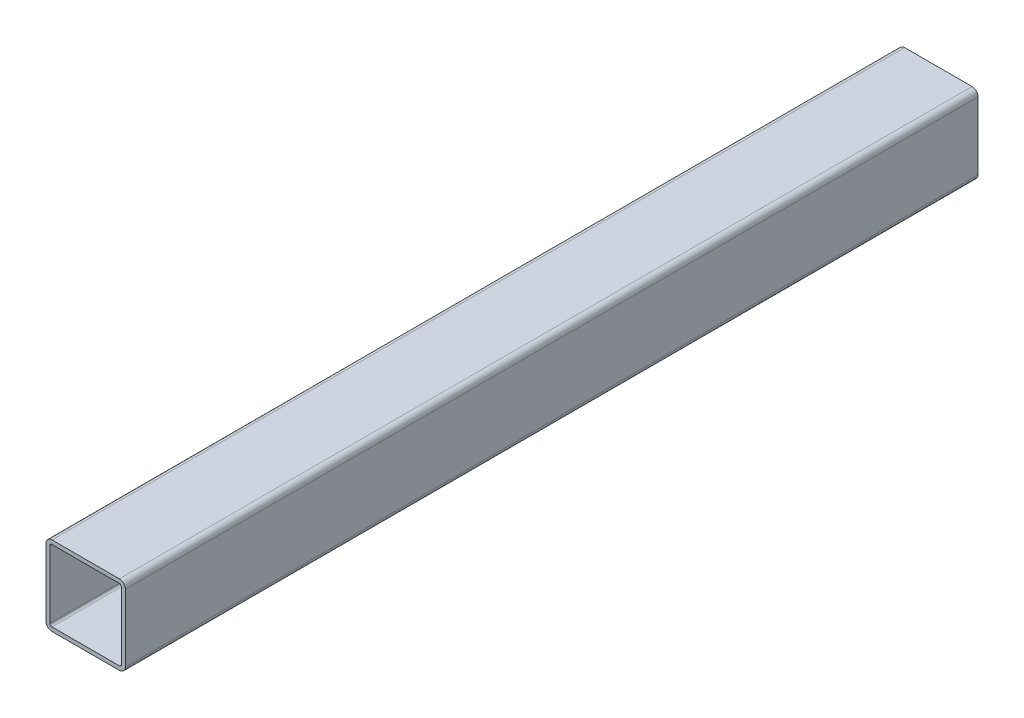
ISO-10303-21;
HEADER;
FILE_DESCRIPTION(('STEP AP214'),'2;1');
FILE_NAME('part.step','',(''),(''),'','','');
FILE_SCHEMA(('AUTOMOTIVE_DESIGN { 1 0 10303 214 1 1 1 1 }'));
ENDSEC;
DATA;
#1=APPLICATION_CONTEXT('core data for automotive mechanical design processes');
#2=APPLICATION_PROTOCOL_DEFINITION('international standard','automotive_design',2000,#1);
#3=PRODUCT_CONTEXT('',#1,'mechanical');
#4=PRODUCT('Part','Part','',(#3));
#5=PRODUCT_RELATED_PRODUCT_CATEGORY('part','',(#4));
#6=PRODUCT_DEFINITION_FORMATION('','',#4);
#7=PRODUCT_DEFINITION_CONTEXT('part definition',#1,'design');
#8=PRODUCT_DEFINITION('design','',#6,#7);
#9=PRODUCT_DEFINITION_SHAPE('','',#8);
#10=(LENGTH_UNIT() NAMED_UNIT(*) SI_UNIT(.MILLI.,.METRE.));
#11=(NAMED_UNIT(*) PLANE_ANGLE_UNIT() SI_UNIT($,.RADIAN.));
#12=(NAMED_UNIT(*) SI_UNIT($,.STERADIAN.) SOLID_ANGLE_UNIT());
#13=UNCERTAINTY_MEASURE_WITH_UNIT(LENGTH_MEASURE(1.E-05),#10,'distance_accuracy_value','');
#14=(GEOMETRIC_REPRESENTATION_CONTEXT(3) GLOBAL_UNCERTAINTY_ASSIGNED_CONTEXT((#13)) GLOBAL_UNIT_ASSIGNED_CONTEXT((#10,
#11,#12)) REPRESENTATION_CONTEXT('',''));
#15=CARTESIAN_POINT('',(0.,0.,0.));
#16=DIRECTION('',(0.,0.,1.));
#17=DIRECTION('',(1.,0.,0.));
#18=AXIS2_PLACEMENT_3D('',#15,#16,#17);
#19=CARTESIAN_POINT('',(3.,37.,430.));
#20=DIRECTION('',(0.,0.,1.));
#21=DIRECTION('',(1.,0.,0.));
#22=AXIS2_PLACEMENT_3D('',#19,#20,#21);
#23=PLANE('',#22);
#24=CARTESIAN_POINT('',(3.,37.,430.));
#25=DIRECTION('',(0.,0.,1.));
#26=DIRECTION('',(1.,0.,0.));
#27=AXIS2_PLACEMENT_3D('',#24,#25,#26);
#28=CIRCLE('',#27,3.);
#29=CARTESIAN_POINT('',(3.00000000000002,40.,430.));
#30=VERTEX_POINT('',#29);
#31=CARTESIAN_POINT('',(0.,37.,430.));
#32=VERTEX_POINT('',#31);
#33=EDGE_CURVE('E217',#30,#32,#28,.T.);
#34=ORIENTED_EDGE('',*,*,#33,.T.);
#35=DIRECTION('',(0.,-1.,0.));
#36=VECTOR('',#35,1.);
#37=CARTESIAN_POINT('',(0.,3.00000000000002,430.));
#38=LINE('',#37,#36);
#39=CARTESIAN_POINT('',(0.,3.00000000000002,430.));
#40=VERTEX_POINT('',#39);
#41=EDGE_CURVE('E220',#32,#40,#38,.T.);
#42=ORIENTED_EDGE('',*,*,#41,.T.);
#43=CARTESIAN_POINT('',(3.,3.,430.));
#44=DIRECTION('',(0.,0.,1.));
#45=DIRECTION('',(1.,0.,0.));
#46=AXIS2_PLACEMENT_3D('',#43,#44,#45);
#47=CIRCLE('',#46,3.);
#48=CARTESIAN_POINT('',(3.00000000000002,0.,430.));
#49=VERTEX_POINT('',#48);
#50=EDGE_CURVE('E222',#40,#49,#47,.T.);
#51=ORIENTED_EDGE('',*,*,#50,.T.);
#52=DIRECTION('',(1.,0.,0.));
#53=VECTOR('',#52,1.);
#54=CARTESIAN_POINT('',(3.00000000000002,0.,430.));
#55=LINE('',#54,#53);
#56=CARTESIAN_POINT('',(37.,0.,430.));
#57=VERTEX_POINT('',#56);
#58=EDGE_CURVE('E224',#49,#57,#55,.T.);
#59=ORIENTED_EDGE('',*,*,#58,.T.);
#60=CARTESIAN_POINT('',(37.,3.,430.));
#61=DIRECTION('',(0.,0.,1.));
#62=DIRECTION('',(1.,0.,0.));
#63=AXIS2_PLACEMENT_3D('',#60,#61,#62);
#64=CIRCLE('',#63,3.);
#65=CARTESIAN_POINT('',(40.,3.00000000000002,430.));
#66=VERTEX_POINT('',#65);
#67=EDGE_CURVE('E226',#57,#66,#64,.T.);
#68=ORIENTED_EDGE('',*,*,#67,.T.);
#69=DIRECTION('',(0.,1.,0.));
#70=VECTOR('',#69,1.);
#71=CARTESIAN_POINT('',(40.,3.00000000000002,430.));
#72=LINE('',#71,#70);
#73=CARTESIAN_POINT('',(40.,37.,430.));
#74=VERTEX_POINT('',#73);
#75=EDGE_CURVE('E228',#66,#74,#72,.T.);
#76=ORIENTED_EDGE('',*,*,#75,.T.);
#77=CARTESIAN_POINT('',(37.,37.,430.));
#78=DIRECTION('',(0.,0.,1.));
#79=DIRECTION('',(1.,0.,0.));
#80=AXIS2_PLACEMENT_3D('',#77,#78,#79);
#81=CIRCLE('',#80,3.);
#82=CARTESIAN_POINT('',(37.,40.,430.));
#83=VERTEX_POINT('',#82);
#84=EDGE_CURVE('E230',#74,#83,#81,.T.);
#85=ORIENTED_EDGE('',*,*,#84,.T.);
#86=DIRECTION('',(-1.,0.,0.));
#87=VECTOR('',#86,1.);
#88=CARTESIAN_POINT('',(3.00000000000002,40.,430.));
#89=LINE('',#88,#87);
#90=EDGE_CURVE('E232',#83,#30,#89,.T.);
#91=ORIENTED_EDGE('',*,*,#90,.T.);
#92=EDGE_LOOP('',(#34,#42,#51,#59,#68,#76,#85,#91));
#93=FACE_BOUND('',#92,.T.);
#94=DIRECTION('',(0.,-1.,0.));
#95=VECTOR('',#94,1.);
#96=CARTESIAN_POINT('',(2.,3.00000000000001,430.));
#97=LINE('',#96,#95);
#98=CARTESIAN_POINT('',(2.,37.,430.));
#99=VERTEX_POINT('',#98);
#100=CARTESIAN_POINT('',(2.,3.00000000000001,430.));
#101=VERTEX_POINT('',#100);
#102=EDGE_CURVE('E175',#99,#101,#97,.T.);
#103=ORIENTED_EDGE('',*,*,#102,.F.);
#104=CARTESIAN_POINT('',(3.,37.,430.));
#105=DIRECTION('',(0.,0.,1.));
#106=DIRECTION('',(1.,0.,0.));
#107=AXIS2_PLACEMENT_3D('',#104,#105,#106);
#108=CIRCLE('',#107,1.);
#109=CARTESIAN_POINT('',(3.00000000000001,38.,430.));
#110=VERTEX_POINT('',#109);
#111=EDGE_CURVE('E152',#110,#99,#108,.T.);
#112=ORIENTED_EDGE('',*,*,#111,.F.);
#113=DIRECTION('',(-1.,0.,0.));
#114=VECTOR('',#113,1.);
#115=CARTESIAN_POINT('',(3.00000000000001,38.,430.));
#116=LINE('',#115,#114);
#117=CARTESIAN_POINT('',(37.,38.,430.));
#118=VERTEX_POINT('',#117);
#119=EDGE_CURVE('E187',#118,#110,#116,.T.);
#120=ORIENTED_EDGE('',*,*,#119,.F.);
#121=CARTESIAN_POINT('',(37.,37.,430.));
#122=DIRECTION('',(0.,0.,1.));
#123=DIRECTION('',(1.,0.,0.));
#124=AXIS2_PLACEMENT_3D('',#121,#122,#123);
#125=CIRCLE('',#124,1.);
#126=CARTESIAN_POINT('',(38.,37.,430.));
#127=VERTEX_POINT('',#126);
#128=EDGE_CURVE('E185',#127,#118,#125,.T.);
#129=ORIENTED_EDGE('',*,*,#128,.F.);
#130=DIRECTION('',(0.,1.,0.));
#131=VECTOR('',#130,1.);
#132=CARTESIAN_POINT('',(38.,3.00000000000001,430.));
#133=LINE('',#132,#131);
#134=CARTESIAN_POINT('',(38.,3.00000000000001,430.));
#135=VERTEX_POINT('',#134);
#136=EDGE_CURVE('E183',#135,#127,#133,.T.);
#137=ORIENTED_EDGE('',*,*,#136,.F.);
#138=CARTESIAN_POINT('',(37.,3.,430.));
#139=DIRECTION('',(0.,0.,1.));
#140=DIRECTION('',(1.,0.,0.));
#141=AXIS2_PLACEMENT_3D('',#138,#139,#140);
#142=CIRCLE('',#141,1.);
#143=CARTESIAN_POINT('',(37.,2.,430.));
#144=VERTEX_POINT('',#143);
#145=EDGE_CURVE('E181',#144,#135,#142,.T.);
#146=ORIENTED_EDGE('',*,*,#145,.F.);
#147=DIRECTION('',(1.,0.,0.));
#148=VECTOR('',#147,1.);
#149=CARTESIAN_POINT('',(3.00000000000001,2.,430.));
#150=LINE('',#149,#148);
#151=CARTESIAN_POINT('',(3.00000000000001,2.,430.));
#152=VERTEX_POINT('',#151);
#153=EDGE_CURVE('E179',#152,#144,#150,.T.);
#154=ORIENTED_EDGE('',*,*,#153,.F.);
#155=CARTESIAN_POINT('',(3.,3.,430.));
#156=DIRECTION('',(0.,0.,1.));
#157=DIRECTION('',(1.,0.,0.));
#158=AXIS2_PLACEMENT_3D('',#155,#156,#157);
#159=CIRCLE('',#158,1.);
#160=EDGE_CURVE('E177',#101,#152,#159,.T.);
#161=ORIENTED_EDGE('',*,*,#160,.F.);
#162=EDGE_LOOP('',(#103,#112,#120,#129,#137,#146,#154,#161));
#163=FACE_BOUND('',#162,.T.);
#164=ADVANCED_FACE('F24',(#93,#163),#23,.T.);
#165=CARTESIAN_POINT('',(3.,37.,0.));
#166=DIRECTION('',(0.,0.,1.));
#167=DIRECTION('',(1.,0.,0.));
#168=AXIS2_PLACEMENT_3D('',#165,#166,#167);
#169=PLANE('',#168);
#170=CARTESIAN_POINT('',(3.,37.,0.));
#171=DIRECTION('',(0.,0.,1.));
#172=DIRECTION('',(1.,0.,0.));
#173=AXIS2_PLACEMENT_3D('',#170,#171,#172);
#174=CIRCLE('',#173,3.);
#175=CARTESIAN_POINT('',(3.00000000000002,40.,0.));
#176=VERTEX_POINT('',#175);
#177=CARTESIAN_POINT('',(0.,37.,0.));
#178=VERTEX_POINT('',#177);
#179=EDGE_CURVE('E153',#176,#178,#174,.T.);
#180=ORIENTED_EDGE('',*,*,#179,.F.);
#181=DIRECTION('',(-1.,0.,0.));
#182=VECTOR('',#181,1.);
#183=CARTESIAN_POINT('',(3.00000000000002,40.,0.));
#184=LINE('',#183,#182);
#185=CARTESIAN_POINT('',(37.,40.,0.));
#186=VERTEX_POINT('',#185);
#187=EDGE_CURVE('E215',#186,#176,#184,.T.);
#188=ORIENTED_EDGE('',*,*,#187,.F.);
#189=CARTESIAN_POINT('',(37.,37.,0.));
#190=DIRECTION('',(0.,0.,1.));
#191=DIRECTION('',(1.,0.,0.));
#192=AXIS2_PLACEMENT_3D('',#189,#190,#191);
#193=CIRCLE('',#192,3.);
#194=CARTESIAN_POINT('',(40.,37.,0.));
#195=VERTEX_POINT('',#194);
#196=EDGE_CURVE('E213',#195,#186,#193,.T.);
#197=ORIENTED_EDGE('',*,*,#196,.F.);
#198=DIRECTION('',(0.,1.,0.));
#199=VECTOR('',#198,1.);
#200=CARTESIAN_POINT('',(40.,3.00000000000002,0.));
#201=LINE('',#200,#199);
#202=CARTESIAN_POINT('',(40.,3.00000000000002,0.));
#203=VERTEX_POINT('',#202);
#204=EDGE_CURVE('E211',#203,#195,#201,.T.);
#205=ORIENTED_EDGE('',*,*,#204,.F.);
#206=CARTESIAN_POINT('',(37.,3.,0.));
#207=DIRECTION('',(0.,0.,1.));
#208=DIRECTION('',(1.,0.,0.));
#209=AXIS2_PLACEMENT_3D('',#206,#207,#208);
#210=CIRCLE('',#209,3.);
#211=CARTESIAN_POINT('',(37.,0.,0.));
#212=VERTEX_POINT('',#211);
#213=EDGE_CURVE('E209',#212,#203,#210,.T.);
#214=ORIENTED_EDGE('',*,*,#213,.F.);
#215=DIRECTION('',(1.,0.,0.));
#216=VECTOR('',#215,1.);
#217=CARTESIAN_POINT('',(3.00000000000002,0.,0.));
#218=LINE('',#217,#216);
#219=CARTESIAN_POINT('',(3.00000000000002,0.,0.));
#220=VERTEX_POINT('',#219);
#221=EDGE_CURVE('E207',#220,#212,#218,.T.);
#222=ORIENTED_EDGE('',*,*,#221,.F.);
#223=CARTESIAN_POINT('',(3.,3.,0.));
#224=DIRECTION('',(0.,0.,1.));
#225=DIRECTION('',(1.,0.,0.));
#226=AXIS2_PLACEMENT_3D('',#223,#224,#225);
#227=CIRCLE('',#226,3.);
#228=CARTESIAN_POINT('',(0.,3.00000000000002,0.));
#229=VERTEX_POINT('',#228);
#230=EDGE_CURVE('E205',#229,#220,#227,.T.);
#231=ORIENTED_EDGE('',*,*,#230,.F.);
#232=DIRECTION('',(0.,-1.,0.));
#233=VECTOR('',#232,1.);
#234=CARTESIAN_POINT('',(0.,3.00000000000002,0.));
#235=LINE('',#234,#233);
#236=EDGE_CURVE('E203',#178,#229,#235,.T.);
#237=ORIENTED_EDGE('',*,*,#236,.F.);
#238=EDGE_LOOP('',(#180,#188,#197,#205,#214,#222,#231,#237));
#239=FACE_BOUND('',#238,.T.);
#240=CARTESIAN_POINT('',(3.,37.,0.));
#241=DIRECTION('',(0.,0.,1.));
#242=DIRECTION('',(1.,0.,0.));
#243=AXIS2_PLACEMENT_3D('',#240,#241,#242);
#244=CIRCLE('',#243,1.);
#245=CARTESIAN_POINT('',(3.00000000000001,38.,0.));
#246=VERTEX_POINT('',#245);
#247=CARTESIAN_POINT('',(2.,37.,0.));
#248=VERTEX_POINT('',#247);
#249=EDGE_CURVE('E47',#246,#248,#244,.T.);
#250=ORIENTED_EDGE('',*,*,#249,.T.);
#251=DIRECTION('',(0.,-1.,0.));
#252=VECTOR('',#251,1.);
#253=CARTESIAN_POINT('',(2.,3.00000000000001,0.));
#254=LINE('',#253,#252);
#255=CARTESIAN_POINT('',(2.,3.00000000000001,0.));
#256=VERTEX_POINT('',#255);
#257=EDGE_CURVE('E139',#248,#256,#254,.T.);
#258=ORIENTED_EDGE('',*,*,#257,.T.);
#259=CARTESIAN_POINT('',(3.,3.,0.));
#260=DIRECTION('',(0.,0.,1.));
#261=DIRECTION('',(1.,0.,0.));
#262=AXIS2_PLACEMENT_3D('',#259,#260,#261);
#263=CIRCLE('',#262,1.);
#264=CARTESIAN_POINT('',(3.00000000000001,2.,0.));
#265=VERTEX_POINT('',#264);
#266=EDGE_CURVE('E148',#256,#265,#263,.T.);
#267=ORIENTED_EDGE('',*,*,#266,.T.);
#268=DIRECTION('',(1.,0.,0.));
#269=VECTOR('',#268,1.);
#270=CARTESIAN_POINT('',(3.00000000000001,2.,0.));
#271=LINE('',#270,#269);
#272=CARTESIAN_POINT('',(37.,2.,0.));
#273=VERTEX_POINT('',#272);
#274=EDGE_CURVE('E162',#265,#273,#271,.T.);
#275=ORIENTED_EDGE('',*,*,#274,.T.);
#276=CARTESIAN_POINT('',(37.,3.,0.));
#277=DIRECTION('',(0.,0.,1.));
#278=DIRECTION('',(1.,0.,0.));
#279=AXIS2_PLACEMENT_3D('',#276,#277,#278);
#280=CIRCLE('',#279,1.);
#281=CARTESIAN_POINT('',(38.,3.00000000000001,0.));
#282=VERTEX_POINT('',#281);
#283=EDGE_CURVE('E165',#273,#282,#280,.T.);
#284=ORIENTED_EDGE('',*,*,#283,.T.);
#285=DIRECTION('',(0.,1.,0.));
#286=VECTOR('',#285,1.);
#287=CARTESIAN_POINT('',(38.,3.00000000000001,0.));
#288=LINE('',#287,#286);
#289=CARTESIAN_POINT('',(38.,37.,0.));
#290=VERTEX_POINT('',#289);
#291=EDGE_CURVE('E168',#282,#290,#288,.T.);
#292=ORIENTED_EDGE('',*,*,#291,.T.);
#293=CARTESIAN_POINT('',(37.,37.,0.));
#294=DIRECTION('',(0.,0.,1.));
#295=DIRECTION('',(1.,0.,0.));
#296=AXIS2_PLACEMENT_3D('',#293,#294,#295);
#297=CIRCLE('',#296,1.);
#298=CARTESIAN_POINT('',(37.,38.,0.));
#299=VERTEX_POINT('',#298);
#300=EDGE_CURVE('E171',#290,#299,#297,.T.);
#301=ORIENTED_EDGE('',*,*,#300,.T.);
#302=DIRECTION('',(-1.,0.,0.));
#303=VECTOR('',#302,1.);
#304=CARTESIAN_POINT('',(3.00000000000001,38.,0.));
#305=LINE('',#304,#303);
#306=EDGE_CURVE('E158',#299,#246,#305,.T.);
#307=ORIENTED_EDGE('',*,*,#306,.T.);
#308=EDGE_LOOP('',(#250,#258,#267,#275,#284,#292,#301,#307));
#309=FACE_BOUND('',#308,.T.);
#310=ADVANCED_FACE('F156',(#239,#309),#169,.F.);
#311=CARTESIAN_POINT('',(3.,37.,430.));
#312=DIRECTION('',(0.,0.,-1.));
#313=DIRECTION('',(-1.,0.,0.));
#314=AXIS2_PLACEMENT_3D('',#311,#312,#313);
#315=CYLINDRICAL_SURFACE('',#314,3.);
#316=ORIENTED_EDGE('',*,*,#179,.T.);
#317=DIRECTION('',(0.,0.,-1.));
#318=VECTOR('',#317,1.);
#319=CARTESIAN_POINT('',(0.,37.,430.));
#320=LINE('',#319,#318);
#321=EDGE_CURVE('E11',#32,#178,#320,.T.);
#322=ORIENTED_EDGE('',*,*,#321,.F.);
#323=ORIENTED_EDGE('',*,*,#33,.F.);
#324=DIRECTION('',(0.,0.,-1.));
#325=VECTOR('',#324,1.);
#326=CARTESIAN_POINT('',(3.00000000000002,40.,430.));
#327=LINE('',#326,#325);
#328=EDGE_CURVE('E234',#30,#176,#327,.T.);
#329=ORIENTED_EDGE('',*,*,#328,.T.);
#330=EDGE_LOOP('',(#316,#322,#323,#329));
#331=FACE_BOUND('',#330,.T.);
#332=ADVANCED_FACE('F26',(#331),#315,.T.);
#333=CARTESIAN_POINT('',(0.,3.00000000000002,430.));
#334=DIRECTION('',(1.,0.,0.));
#335=DIRECTION('',(0.,0.,-1.));
#336=AXIS2_PLACEMENT_3D('',#333,#334,#335);
#337=PLANE('',#336);
#338=ORIENTED_EDGE('',*,*,#236,.T.);
#339=DIRECTION('',(0.,0.,-1.));
#340=VECTOR('',#339,1.);
#341=CARTESIAN_POINT('',(0.,3.00000000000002,430.));
#342=LINE('',#341,#340);
#343=EDGE_CURVE('E32',#40,#229,#342,.T.);
#344=ORIENTED_EDGE('',*,*,#343,.F.);
#345=ORIENTED_EDGE('',*,*,#41,.F.);
#346=ORIENTED_EDGE('',*,*,#321,.T.);
#347=EDGE_LOOP('',(#338,#344,#345,#346));
#348=FACE_BOUND('',#347,.T.);
#349=ADVANCED_FACE('F278',(#348),#337,.F.);
#350=CARTESIAN_POINT('',(3.,3.,430.));
#351=DIRECTION('',(0.,0.,-1.));
#352=DIRECTION('',(-1.,0.,0.));
#353=AXIS2_PLACEMENT_3D('',#350,#351,#352);
#354=CYLINDRICAL_SURFACE('',#353,3.);
#355=ORIENTED_EDGE('',*,*,#230,.T.);
#356=DIRECTION('',(0.,0.,-1.));
#357=VECTOR('',#356,1.);
#358=CARTESIAN_POINT('',(3.00000000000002,0.,430.));
#359=LINE('',#358,#357);
#360=EDGE_CURVE('E249',#49,#220,#359,.T.);
#361=ORIENTED_EDGE('',*,*,#360,.F.);
#362=ORIENTED_EDGE('',*,*,#50,.F.);
#363=ORIENTED_EDGE('',*,*,#343,.T.);
#364=EDGE_LOOP('',(#355,#361,#362,#363));
#365=FACE_BOUND('',#364,.T.);
#366=ADVANCED_FACE('F256',(#365),#354,.T.);
#367=CARTESIAN_POINT('',(3.00000000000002,0.,430.));
#368=DIRECTION('',(0.,1.,0.));
#369=DIRECTION('',(0.,0.,1.));
#370=AXIS2_PLACEMENT_3D('',#367,#368,#369);
#371=PLANE('',#370);
#372=ORIENTED_EDGE('',*,*,#221,.T.);
#373=DIRECTION('',(0.,0.,-1.));
#374=VECTOR('',#373,1.);
#375=CARTESIAN_POINT('',(37.,0.,430.));
#376=LINE('',#375,#374);
#377=EDGE_CURVE('E246',#57,#212,#376,.T.);
#378=ORIENTED_EDGE('',*,*,#377,.F.);
#379=ORIENTED_EDGE('',*,*,#58,.F.);
#380=ORIENTED_EDGE('',*,*,#360,.T.);
#381=EDGE_LOOP('',(#372,#378,#379,#380));
#382=FACE_BOUND('',#381,.T.);
#383=ADVANCED_FACE('F266',(#382),#371,.F.);
#384=CARTESIAN_POINT('',(37.,3.,430.));
#385=DIRECTION('',(0.,0.,-1.));
#386=DIRECTION('',(-1.,0.,0.));
#387=AXIS2_PLACEMENT_3D('',#384,#385,#386);
#388=CYLINDRICAL_SURFACE('',#387,3.);
#389=ORIENTED_EDGE('',*,*,#213,.T.);
#390=DIRECTION('',(0.,0.,-1.));
#391=VECTOR('',#390,1.);
#392=CARTESIAN_POINT('',(40.,3.00000000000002,430.));
#393=LINE('',#392,#391);
#394=EDGE_CURVE('E243',#66,#203,#393,.T.);
#395=ORIENTED_EDGE('',*,*,#394,.F.);
#396=ORIENTED_EDGE('',*,*,#67,.F.);
#397=ORIENTED_EDGE('',*,*,#377,.T.);
#398=EDGE_LOOP('',(#389,#395,#396,#397));
#399=FACE_BOUND('',#398,.T.);
#400=ADVANCED_FACE('F270',(#399),#388,.T.);
#401=CARTESIAN_POINT('',(40.,3.00000000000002,430.));
#402=DIRECTION('',(-1.,0.,0.));
#403=DIRECTION('',(0.,0.,1.));
#404=AXIS2_PLACEMENT_3D('',#401,#402,#403);
#405=PLANE('',#404);
#406=ORIENTED_EDGE('',*,*,#204,.T.);
#407=DIRECTION('',(0.,0.,-1.));
#408=VECTOR('',#407,1.);
#409=CARTESIAN_POINT('',(40.,37.,430.));
#410=LINE('',#409,#408);
#411=EDGE_CURVE('E240',#74,#195,#410,.T.);
#412=ORIENTED_EDGE('',*,*,#411,.F.);
#413=ORIENTED_EDGE('',*,*,#75,.F.);
#414=ORIENTED_EDGE('',*,*,#394,.T.);
#415=EDGE_LOOP('',(#406,#412,#413,#414));
#416=FACE_BOUND('',#415,.T.);
#417=ADVANCED_FACE('F291',(#416),#405,.F.);
#418=CARTESIAN_POINT('',(37.,37.,430.));
#419=DIRECTION('',(0.,0.,-1.));
#420=DIRECTION('',(-1.,0.,0.));
#421=AXIS2_PLACEMENT_3D('',#418,#419,#420);
#422=CYLINDRICAL_SURFACE('',#421,3.);
#423=ORIENTED_EDGE('',*,*,#196,.T.);
#424=DIRECTION('',(0.,0.,-1.));
#425=VECTOR('',#424,1.);
#426=CARTESIAN_POINT('',(37.,40.,430.));
#427=LINE('',#426,#425);
#428=EDGE_CURVE('E237',#83,#186,#427,.T.);
#429=ORIENTED_EDGE('',*,*,#428,.F.);
#430=ORIENTED_EDGE('',*,*,#84,.F.);
#431=ORIENTED_EDGE('',*,*,#411,.T.);
#432=EDGE_LOOP('',(#423,#429,#430,#431));
#433=FACE_BOUND('',#432,.T.);
#434=ADVANCED_FACE('F289',(#433),#422,.T.);
#435=CARTESIAN_POINT('',(3.00000000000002,40.,430.));
#436=DIRECTION('',(0.,-1.,0.));
#437=DIRECTION('',(0.,0.,-1.));
#438=AXIS2_PLACEMENT_3D('',#435,#436,#437);
#439=PLANE('',#438);
#440=ORIENTED_EDGE('',*,*,#187,.T.);
#441=ORIENTED_EDGE('',*,*,#328,.F.);
#442=ORIENTED_EDGE('',*,*,#90,.F.);
#443=ORIENTED_EDGE('',*,*,#428,.T.);
#444=EDGE_LOOP('',(#440,#441,#442,#443));
#445=FACE_BOUND('',#444,.T.);
#446=ADVANCED_FACE('F284',(#445),#439,.F.);
#447=CARTESIAN_POINT('',(3.,37.,430.));
#448=DIRECTION('',(0.,0.,-1.));
#449=DIRECTION('',(-1.,0.,0.));
#450=AXIS2_PLACEMENT_3D('',#447,#448,#449);
#451=CYLINDRICAL_SURFACE('',#450,1.);
#452=ORIENTED_EDGE('',*,*,#249,.F.);
#453=DIRECTION('',(0.,0.,-1.));
#454=VECTOR('',#453,1.);
#455=CARTESIAN_POINT('',(3.00000000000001,38.,430.));
#456=LINE('',#455,#454);
#457=EDGE_CURVE('E189',#110,#246,#456,.T.);
#458=ORIENTED_EDGE('',*,*,#457,.F.);
#459=ORIENTED_EDGE('',*,*,#111,.T.);
#460=DIRECTION('',(0.,0.,-1.));
#461=VECTOR('',#460,1.);
#462=CARTESIAN_POINT('',(2.,37.,430.));
#463=LINE('',#462,#461);
#464=EDGE_CURVE('E141',#99,#248,#463,.T.);
#465=ORIENTED_EDGE('',*,*,#464,.T.);
#466=EDGE_LOOP('',(#452,#458,#459,#465));
#467=FACE_BOUND('',#466,.T.);
#468=ADVANCED_FACE('F150',(#467),#451,.F.);
#469=CARTESIAN_POINT('',(2.,3.00000000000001,430.));
#470=DIRECTION('',(1.,0.,0.));
#471=DIRECTION('',(0.,0.,-1.));
#472=AXIS2_PLACEMENT_3D('',#469,#470,#471);
#473=PLANE('',#472);
#474=ORIENTED_EDGE('',*,*,#257,.F.);
#475=ORIENTED_EDGE('',*,*,#464,.F.);
#476=ORIENTED_EDGE('',*,*,#102,.T.);
#477=DIRECTION('',(0.,0.,-1.));
#478=VECTOR('',#477,1.);
#479=CARTESIAN_POINT('',(2.,3.00000000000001,430.));
#480=LINE('',#479,#478);
#481=EDGE_CURVE('E144',#101,#256,#480,.T.);
#482=ORIENTED_EDGE('',*,*,#481,.T.);
#483=EDGE_LOOP('',(#474,#475,#476,#482));
#484=FACE_BOUND('',#483,.T.);
#485=ADVANCED_FACE('F140',(#484),#473,.T.);
#486=CARTESIAN_POINT('',(3.,3.,430.));
#487=DIRECTION('',(0.,0.,-1.));
#488=DIRECTION('',(-1.,0.,0.));
#489=AXIS2_PLACEMENT_3D('',#486,#487,#488);
#490=CYLINDRICAL_SURFACE('',#489,1.);
#491=ORIENTED_EDGE('',*,*,#266,.F.);
#492=ORIENTED_EDGE('',*,*,#481,.F.);
#493=ORIENTED_EDGE('',*,*,#160,.T.);
#494=DIRECTION('',(0.,0.,-1.));
#495=VECTOR('',#494,1.);
#496=CARTESIAN_POINT('',(3.00000000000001,2.,430.));
#497=LINE('',#496,#495);
#498=EDGE_CURVE('E198',#152,#265,#497,.T.);
#499=ORIENTED_EDGE('',*,*,#498,.T.);
#500=EDGE_LOOP('',(#491,#492,#493,#499));
#501=FACE_BOUND('',#500,.T.);
#502=ADVANCED_FACE('F315',(#501),#490,.F.);
#503=CARTESIAN_POINT('',(3.00000000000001,2.,430.));
#504=DIRECTION('',(0.,1.,0.));
#505=DIRECTION('',(0.,0.,1.));
#506=AXIS2_PLACEMENT_3D('',#503,#504,#505);
#507=PLANE('',#506);
#508=ORIENTED_EDGE('',*,*,#274,.F.);
#509=ORIENTED_EDGE('',*,*,#498,.F.);
#510=ORIENTED_EDGE('',*,*,#153,.T.);
#511=DIRECTION('',(0.,0.,-1.));
#512=VECTOR('',#511,1.);
#513=CARTESIAN_POINT('',(37.,2.,430.));
#514=LINE('',#513,#512);
#515=EDGE_CURVE('E196',#144,#273,#514,.T.);
#516=ORIENTED_EDGE('',*,*,#515,.T.);
#517=EDGE_LOOP('',(#508,#509,#510,#516));
#518=FACE_BOUND('',#517,.T.);
#519=ADVANCED_FACE('F320',(#518),#507,.T.);
#520=CARTESIAN_POINT('',(37.,3.,430.));
#521=DIRECTION('',(0.,0.,-1.));
#522=DIRECTION('',(-1.,0.,0.));
#523=AXIS2_PLACEMENT_3D('',#520,#521,#522);
#524=CYLINDRICAL_SURFACE('',#523,1.);
#525=ORIENTED_EDGE('',*,*,#283,.F.);
#526=ORIENTED_EDGE('',*,*,#515,.F.);
#527=ORIENTED_EDGE('',*,*,#145,.T.);
#528=DIRECTION('',(0.,0.,-1.));
#529=VECTOR('',#528,1.);
#530=CARTESIAN_POINT('',(38.,3.00000000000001,430.));
#531=LINE('',#530,#529);
#532=EDGE_CURVE('E194',#135,#282,#531,.T.);
#533=ORIENTED_EDGE('',*,*,#532,.T.);
#534=EDGE_LOOP('',(#525,#526,#527,#533));
#535=FACE_BOUND('',#534,.T.);
#536=ADVANCED_FACE('F324',(#535),#524,.F.);
#537=CARTESIAN_POINT('',(38.,3.00000000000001,430.));
#538=DIRECTION('',(-1.,0.,0.));
#539=DIRECTION('',(0.,0.,1.));
#540=AXIS2_PLACEMENT_3D('',#537,#538,#539);
#541=PLANE('',#540);
#542=ORIENTED_EDGE('',*,*,#291,.F.);
#543=ORIENTED_EDGE('',*,*,#532,.F.);
#544=ORIENTED_EDGE('',*,*,#136,.T.);
#545=DIRECTION('',(0.,0.,-1.));
#546=VECTOR('',#545,1.);
#547=CARTESIAN_POINT('',(38.,37.,430.));
#548=LINE('',#547,#546);
#549=EDGE_CURVE('E192',#127,#290,#548,.T.);
#550=ORIENTED_EDGE('',*,*,#549,.T.);
#551=EDGE_LOOP('',(#542,#543,#544,#550));
#552=FACE_BOUND('',#551,.T.);
#553=ADVANCED_FACE('F328',(#552),#541,.T.);
#554=CARTESIAN_POINT('',(37.,37.,430.));
#555=DIRECTION('',(0.,0.,-1.));
#556=DIRECTION('',(-1.,0.,0.));
#557=AXIS2_PLACEMENT_3D('',#554,#555,#556);
#558=CYLINDRICAL_SURFACE('',#557,1.);
#559=ORIENTED_EDGE('',*,*,#300,.F.);
#560=ORIENTED_EDGE('',*,*,#549,.F.);
#561=ORIENTED_EDGE('',*,*,#128,.T.);
#562=DIRECTION('',(0.,0.,-1.));
#563=VECTOR('',#562,1.);
#564=CARTESIAN_POINT('',(37.,38.,430.));
#565=LINE('',#564,#563);
#566=EDGE_CURVE('E39',#118,#299,#565,.T.);
#567=ORIENTED_EDGE('',*,*,#566,.T.);
#568=EDGE_LOOP('',(#559,#560,#561,#567));
#569=FACE_BOUND('',#568,.T.);
#570=ADVANCED_FACE('F332',(#569),#558,.F.);
#571=CARTESIAN_POINT('',(3.00000000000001,38.,430.));
#572=DIRECTION('',(0.,-1.,0.));
#573=DIRECTION('',(0.,0.,-1.));
#574=AXIS2_PLACEMENT_3D('',#571,#572,#573);
#575=PLANE('',#574);
#576=ORIENTED_EDGE('',*,*,#306,.F.);
#577=ORIENTED_EDGE('',*,*,#566,.F.);
#578=ORIENTED_EDGE('',*,*,#119,.T.);
#579=ORIENTED_EDGE('',*,*,#457,.T.);
#580=EDGE_LOOP('',(#576,#577,#578,#579));
#581=FACE_BOUND('',#580,.T.);
#582=ADVANCED_FACE('F336',(#581),#575,.T.);
#583=CLOSED_SHELL('',(#164,#310,#332,#349,#366,#383,#400,#417,#434,#446,#468,#485,#502,#519,
#536,#553,#570,#582));
#584=MANIFOLD_SOLID_BREP('B2',#583);
#585=ADVANCED_BREP_SHAPE_REPRESENTATION('',(#18,#584),#14);
#586=SHAPE_DEFINITION_REPRESENTATION(#9,#585);
ENDSEC;
END-ISO-10303-21;
